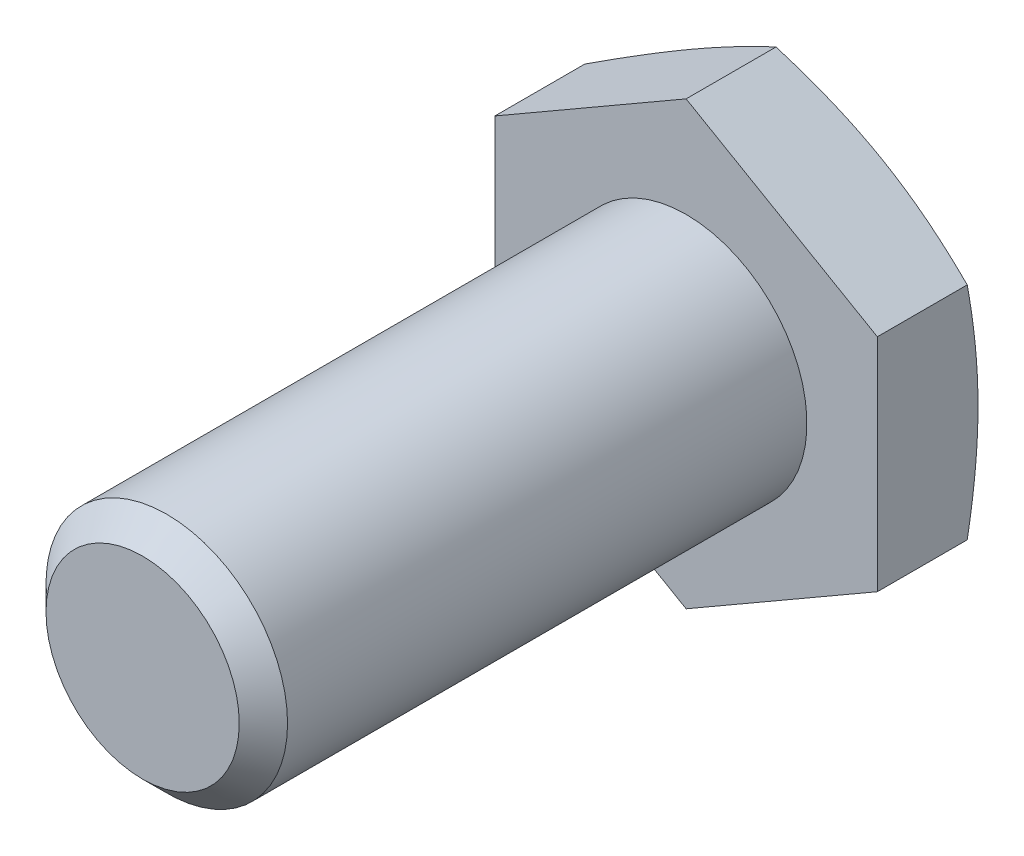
ISO-10303-21;
HEADER;
FILE_DESCRIPTION(('STEP AP214'),'2;1');
FILE_NAME('part.step','',(''),(''),'','','');
FILE_SCHEMA(('AUTOMOTIVE_DESIGN { 1 0 10303 214 1 1 1 1 }'));
ENDSEC;
DATA;
#1=APPLICATION_CONTEXT('core data for automotive mechanical design processes');
#2=APPLICATION_PROTOCOL_DEFINITION('international standard','automotive_design',2000,#1);
#3=PRODUCT_CONTEXT('',#1,'mechanical');
#4=PRODUCT('Part','Part','',(#3));
#5=PRODUCT_RELATED_PRODUCT_CATEGORY('part','',(#4));
#6=PRODUCT_DEFINITION_FORMATION('','',#4);
#7=PRODUCT_DEFINITION_CONTEXT('part definition',#1,'design');
#8=PRODUCT_DEFINITION('design','',#6,#7);
#9=PRODUCT_DEFINITION_SHAPE('','',#8);
#10=(LENGTH_UNIT() NAMED_UNIT(*) SI_UNIT(.MILLI.,.METRE.));
#11=(NAMED_UNIT(*) PLANE_ANGLE_UNIT() SI_UNIT($,.RADIAN.));
#12=(NAMED_UNIT(*) SI_UNIT($,.STERADIAN.) SOLID_ANGLE_UNIT());
#13=UNCERTAINTY_MEASURE_WITH_UNIT(LENGTH_MEASURE(1.E-05),#10,'distance_accuracy_value','');
#14=(GEOMETRIC_REPRESENTATION_CONTEXT(3) GLOBAL_UNCERTAINTY_ASSIGNED_CONTEXT((#13)) GLOBAL_UNIT_ASSIGNED_CONTEXT((#10,
#11,#12)) REPRESENTATION_CONTEXT('',''));
#15=CARTESIAN_POINT('',(0.,0.,0.));
#16=DIRECTION('',(0.,0.,1.));
#17=DIRECTION('',(1.,0.,0.));
#18=AXIS2_PLACEMENT_3D('',#15,#16,#17);
#19=CARTESIAN_POINT('',(0.,0.,20.46325));
#20=DIRECTION('',(0.,0.,1.));
#21=DIRECTION('',(0.,1.,0.));
#22=AXIS2_PLACEMENT_3D('',#19,#20,#21);
#23=CYLINDRICAL_SURFACE('',#22,6.);
#24=CARTESIAN_POINT('',(0.,0.,30.8));
#25=DIRECTION('',(0.,0.,1.));
#26=DIRECTION('',(1.,0.,0.));
#27=AXIS2_PLACEMENT_3D('',#24,#25,#26);
#28=CIRCLE('',#27,6.);
#29=CARTESIAN_POINT('',(6.,0.,30.8));
#30=VERTEX_POINT('',#29);
#31=EDGE_CURVE('E9',#30,#30,#28,.F.);
#32=ORIENTED_EDGE('',*,*,#31,.T.);
#33=EDGE_LOOP('',(#32));
#34=FACE_BOUND('',#33,.T.);
#35=CARTESIAN_POINT('',(0.,0.,5.));
#36=DIRECTION('',(0.,0.,1.));
#37=DIRECTION('',(0.,1.,0.));
#38=AXIS2_PLACEMENT_3D('',#35,#36,#37);
#39=CIRCLE('',#38,6.);
#40=CARTESIAN_POINT('',(0.,6.,5.));
#41=VERTEX_POINT('',#40);
#42=EDGE_CURVE('E194',#41,#41,#39,.F.);
#43=ORIENTED_EDGE('',*,*,#42,.F.);
#44=EDGE_LOOP('',(#43));
#45=FACE_BOUND('',#44,.T.);
#46=ADVANCED_FACE('F14',(#34,#45),#23,.T.);
#47=CARTESIAN_POINT('',(-9.5,5.48482755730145,0.));
#48=DIRECTION('',(0.5,-0.866025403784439,0.));
#49=DIRECTION('',(0.866025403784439,0.5,0.));
#50=AXIS2_PLACEMENT_3D('',#47,#48,#49);
#51=PLANE('',#50);
#52=CARTESIAN_POINT('',(-9.5002,5.48471208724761,0.534952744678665));
#53=CARTESIAN_POINT('',(-9.1067676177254,5.71186037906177,0.452247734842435));
#54=CARTESIAN_POINT('',(-8.71203788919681,5.9397576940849,0.377013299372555));
#55=CARTESIAN_POINT('',(-7.9200119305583,6.39703409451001,0.244650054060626));
#56=CARTESIAN_POINT('',(-7.52271393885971,6.62641419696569,0.187535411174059));
#57=CARTESIAN_POINT('',(-6.72996042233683,7.0841106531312,0.0951541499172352));
#58=CARTESIAN_POINT('',(-6.33452300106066,7.31241655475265,0.0596860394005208));
#59=CARTESIAN_POINT('',(-5.54272345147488,7.76956223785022,0.0121133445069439));
#60=CARTESIAN_POINT('',(-5.14636172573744,7.9984017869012,0.));
#61=CARTESIAN_POINT('',(-4.35363827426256,8.45608088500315,0.));
#62=CARTESIAN_POINT('',(-3.95727654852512,8.68492043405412,0.0121133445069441));
#63=CARTESIAN_POINT('',(-3.16547699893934,9.1420661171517,0.0596860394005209));
#64=CARTESIAN_POINT('',(-2.77003957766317,9.37037201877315,0.0951541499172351));
#65=CARTESIAN_POINT('',(-1.97728606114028,9.82806847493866,0.187535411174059));
#66=CARTESIAN_POINT('',(-1.5799880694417,10.0574485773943,0.244650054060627));
#67=CARTESIAN_POINT('',(-0.787962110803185,10.5147249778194,0.377013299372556));
#68=CARTESIAN_POINT('',(-0.393232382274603,10.7426222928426,0.452247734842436));
#69=CARTESIAN_POINT('',(0.000200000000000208,10.9697705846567,0.534952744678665));
#70=B_SPLINE_CURVE_WITH_KNOTS('',3,(#52,#53,#54,#55,#56,#57,#58,#59,#60,#61,#62,#63,#64,#65,#66,
#67,#68,#69),.UNSPECIFIED.,.F.,.F.,(4,2,2,2,2,2,2,2,4),(0.,1.38543330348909,2.7719471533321,
4.14534984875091,5.51823729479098,6.89112474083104,8.26452743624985,9.65104128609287,
11.036474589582),.UNSPECIFIED.);
#71=CARTESIAN_POINT('',(-9.5,5.48482755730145,0.534910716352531));
#72=VERTEX_POINT('',#71);
#73=CARTESIAN_POINT('',(-4.75,8.22724133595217,0.));
#74=VERTEX_POINT('',#73);
#75=EDGE_CURVE('E84',#72,#74,#70,.T.);
#76=ORIENTED_EDGE('',*,*,#75,.F.);
#77=DIRECTION('',(0.,0.,1.));
#78=VECTOR('',#77,1.);
#79=CARTESIAN_POINT('',(-9.5,5.48482755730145,0.));
#80=LINE('',#79,#78);
#81=CARTESIAN_POINT('',(-9.5,5.48482755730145,5.));
#82=VERTEX_POINT('',#81);
#83=EDGE_CURVE('E258',#72,#82,#80,.T.);
#84=ORIENTED_EDGE('',*,*,#83,.T.);
#85=DIRECTION('',(0.866025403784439,0.5,0.));
#86=VECTOR('',#85,1.);
#87=CARTESIAN_POINT('',(-9.5,5.48482755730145,5.));
#88=LINE('',#87,#86);
#89=CARTESIAN_POINT('',(0.,10.9696551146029,5.));
#90=VERTEX_POINT('',#89);
#91=EDGE_CURVE('E93',#82,#90,#88,.T.);
#92=ORIENTED_EDGE('',*,*,#91,.T.);
#93=DIRECTION('',(0.,0.,1.));
#94=VECTOR('',#93,1.);
#95=CARTESIAN_POINT('',(0.,10.9696551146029,0.));
#96=LINE('',#95,#94);
#97=CARTESIAN_POINT('',(0.,10.9696551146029,0.534910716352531));
#98=VERTEX_POINT('',#97);
#99=EDGE_CURVE('E112',#98,#90,#96,.T.);
#100=ORIENTED_EDGE('',*,*,#99,.F.);
#101=EDGE_CURVE('E94',#74,#98,#70,.T.);
#102=ORIENTED_EDGE('',*,*,#101,.F.);
#103=EDGE_LOOP('',(#76,#84,#92,#100,#102));
#104=FACE_BOUND('',#103,.T.);
#105=ADVANCED_FACE('F110',(#104),#51,.F.);
#106=CARTESIAN_POINT('',(0.,10.9696551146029,0.));
#107=DIRECTION('',(-0.5,-0.866025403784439,0.));
#108=DIRECTION('',(0.866025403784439,-0.5,0.));
#109=AXIS2_PLACEMENT_3D('',#106,#107,#108);
#110=PLANE('',#109);
#111=CARTESIAN_POINT('',(-0.00020000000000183,10.9697705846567,0.534952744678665));
#112=CARTESIAN_POINT('',(0.393232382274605,10.7426222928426,0.452247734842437));
#113=CARTESIAN_POINT('',(0.787962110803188,10.5147249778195,0.377013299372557));
#114=CARTESIAN_POINT('',(1.5799880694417,10.0574485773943,0.244650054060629));
#115=CARTESIAN_POINT('',(1.97728606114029,9.82806847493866,0.18753541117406));
#116=CARTESIAN_POINT('',(2.77003957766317,9.37037201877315,0.0951541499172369));
#117=CARTESIAN_POINT('',(3.16547699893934,9.1420661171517,0.0596860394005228));
#118=CARTESIAN_POINT('',(3.95727654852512,8.68492043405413,0.0121133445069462));
#119=CARTESIAN_POINT('',(4.35363827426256,8.45608088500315,0.));
#120=CARTESIAN_POINT('',(5.14636172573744,7.9984017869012,0.));
#121=CARTESIAN_POINT('',(5.54272345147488,7.76956223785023,0.012113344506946));
#122=CARTESIAN_POINT('',(6.33452300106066,7.31241655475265,0.0596860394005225));
#123=CARTESIAN_POINT('',(6.72996042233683,7.0841106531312,0.0951541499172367));
#124=CARTESIAN_POINT('',(7.52271393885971,6.62641419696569,0.18753541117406));
#125=CARTESIAN_POINT('',(7.9200119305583,6.39703409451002,0.244650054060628));
#126=CARTESIAN_POINT('',(8.71203788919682,5.9397576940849,0.377013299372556));
#127=CARTESIAN_POINT('',(9.1067676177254,5.71186037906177,0.452247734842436));
#128=CARTESIAN_POINT('',(9.5002,5.48471208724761,0.534952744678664));
#129=B_SPLINE_CURVE_WITH_KNOTS('',3,(#111,#112,#113,#114,#115,#116,#117,#118,#119,#120,#121,
#122,#123,#124,#125,#126,#127,#128),.UNSPECIFIED.,.F.,.F.,(4,2,2,2,2,2,2,2,4),(0.,
1.38543330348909,2.77194715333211,4.14534984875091,5.51823729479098,6.89112474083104,
8.26452743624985,9.65104128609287,11.036474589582),.UNSPECIFIED.);
#130=CARTESIAN_POINT('',(4.75,8.22724133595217,0.));
#131=VERTEX_POINT('',#130);
#132=EDGE_CURVE('E101',#98,#131,#129,.T.);
#133=ORIENTED_EDGE('',*,*,#132,.F.);
#134=ORIENTED_EDGE('',*,*,#99,.T.);
#135=DIRECTION('',(0.866025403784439,-0.5,0.));
#136=VECTOR('',#135,1.);
#137=CARTESIAN_POINT('',(0.,10.9696551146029,5.));
#138=LINE('',#137,#136);
#139=CARTESIAN_POINT('',(9.5,5.48482755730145,5.));
#140=VERTEX_POINT('',#139);
#141=EDGE_CURVE('E270',#90,#140,#138,.T.);
#142=ORIENTED_EDGE('',*,*,#141,.T.);
#143=DIRECTION('',(0.,0.,1.));
#144=VECTOR('',#143,1.);
#145=CARTESIAN_POINT('',(9.5,5.48482755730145,0.));
#146=LINE('',#145,#144);
#147=CARTESIAN_POINT('',(9.5,5.48482755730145,0.534910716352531));
#148=VERTEX_POINT('',#147);
#149=EDGE_CURVE('E199',#148,#140,#146,.T.);
#150=ORIENTED_EDGE('',*,*,#149,.F.);
#151=EDGE_CURVE('E113',#131,#148,#129,.T.);
#152=ORIENTED_EDGE('',*,*,#151,.F.);
#153=EDGE_LOOP('',(#133,#134,#142,#150,#152));
#154=FACE_BOUND('',#153,.T.);
#155=ADVANCED_FACE('F174',(#154),#110,.F.);
#156=CARTESIAN_POINT('',(9.5,5.48482755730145,0.));
#157=DIRECTION('',(-1.,0.,0.));
#158=DIRECTION('',(0.,-1.,0.));
#159=AXIS2_PLACEMENT_3D('',#156,#157,#158);
#160=PLANE('',#159);
#161=CARTESIAN_POINT('',(9.5,-14.6309135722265,2.89159336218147));
#162=CARTESIAN_POINT('',(9.5,-14.1998786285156,2.7600499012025));
#163=CARTESIAN_POINT('',(9.5,-13.7683740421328,2.63001767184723));
#164=CARTESIAN_POINT('',(9.5,-12.9041861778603,2.3738115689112));
#165=CARTESIAN_POINT('',(9.5,-12.47150281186,2.24763799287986));
#166=CARTESIAN_POINT('',(9.5,-11.6040051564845,1.99978299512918));
#167=CARTESIAN_POINT('',(9.5,-11.1691884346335,1.87811005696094));
#168=CARTESIAN_POINT('',(9.5,-10.2979524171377,1.64065204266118));
#169=CARTESIAN_POINT('',(9.5,-9.86153314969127,1.52486686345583));
#170=CARTESIAN_POINT('',(9.5,-8.99217782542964,1.30202273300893));
#171=CARTESIAN_POINT('',(9.5,-8.55926489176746,1.19487401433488));
#172=CARTESIAN_POINT('',(9.5,-7.69129747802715,0.989535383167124));
#173=CARTESIAN_POINT('',(9.5,-7.25624296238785,0.891345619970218));
#174=CARTESIAN_POINT('',(9.5,-6.38387219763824,0.706177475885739));
#175=CARTESIAN_POINT('',(9.5,-5.94655667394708,0.619195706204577));
#176=CARTESIAN_POINT('',(9.5,-5.06938183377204,0.459061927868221));
#177=CARTESIAN_POINT('',(9.5,-4.62952260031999,0.385909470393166));
#178=CARTESIAN_POINT('',(9.5,-3.79653815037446,0.263604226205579));
#179=CARTESIAN_POINT('',(9.5,-3.40367484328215,0.212684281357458));
#180=CARTESIAN_POINT('',(9.5,-2.61625424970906,0.126124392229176));
#181=CARTESIAN_POINT('',(9.5,-2.22169701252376,0.0904840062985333));
#182=CARTESIAN_POINT('',(9.5,-1.43169160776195,0.0361978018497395));
#183=CARTESIAN_POINT('',(9.5,-1.03624432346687,0.0175393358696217));
#184=CARTESIAN_POINT('',(9.5,-0.244905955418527,-0.00183608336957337));
#185=CARTESIAN_POINT('',(9.5,0.150985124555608,-0.00255318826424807));
#186=CARTESIAN_POINT('',(9.5,0.944424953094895,0.0140366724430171));
#187=CARTESIAN_POINT('',(9.5,1.34197172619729,0.0314365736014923));
#188=CARTESIAN_POINT('',(9.5,2.13592669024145,0.0834642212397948));
#189=CARTESIAN_POINT('',(9.5,2.53233485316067,0.118092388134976));
#190=CARTESIAN_POINT('',(9.5,3.32380967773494,0.202933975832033));
#191=CARTESIAN_POINT('',(9.5,3.71887484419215,0.25316114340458));
#192=CARTESIAN_POINT('',(9.5,4.50702768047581,0.367130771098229));
#193=CARTESIAN_POINT('',(9.5,4.90011534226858,0.430873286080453));
#194=CARTESIAN_POINT('',(9.5,5.71532347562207,0.575266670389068));
#195=CARTESIAN_POINT('',(9.5,6.13727606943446,0.656857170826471));
#196=CARTESIAN_POINT('',(9.5,6.97895159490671,0.830893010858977));
#197=CARTESIAN_POINT('',(9.5,7.39867433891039,0.923339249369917));
#198=CARTESIAN_POINT('',(9.5,8.23621124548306,1.11703654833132));
#199=CARTESIAN_POINT('',(9.5,8.65402475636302,1.21829040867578));
#200=CARTESIAN_POINT('',(9.5,9.48785199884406,1.42787566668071));
#201=CARTESIAN_POINT('',(9.5,9.90386577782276,1.53620687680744));
#202=CARTESIAN_POINT('',(9.5,10.734936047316,1.7587464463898));
#203=CARTESIAN_POINT('',(9.5,11.1499903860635,1.87296281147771));
#204=CARTESIAN_POINT('',(9.5,11.9787867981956,2.10605530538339));
#205=CARTESIAN_POINT('',(9.5,12.3925288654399,2.22493145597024));
#206=CARTESIAN_POINT('',(9.5,13.2188199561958,2.46646846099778));
#207=CARTESIAN_POINT('',(9.5,13.6313691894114,2.58912859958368));
#208=CARTESIAN_POINT('',(9.5,14.4555220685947,2.83758902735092));
#209=CARTESIAN_POINT('',(9.5,14.8671257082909,2.9633893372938));
#210=CARTESIAN_POINT('',(9.5,16.0914965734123,3.34181762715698));
#211=CARTESIAN_POINT('',(9.5,16.9030990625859,3.59821304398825));
#212=CARTESIAN_POINT('',(9.5,18.5240472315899,4.11814919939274));
#213=CARTESIAN_POINT('',(9.5,19.3333927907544,4.38169031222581));
#214=CARTESIAN_POINT('',(9.5,20.9471132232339,4.91291456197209));
#215=CARTESIAN_POINT('',(9.5,21.7514949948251,5.18057677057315));
#216=CARTESIAN_POINT('',(9.5,22.9570565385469,5.58496407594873));
#217=CARTESIAN_POINT('',(9.5,23.3587249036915,5.7202363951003));
#218=CARTESIAN_POINT('',(9.5,24.161772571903,5.99163334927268));
#219=CARTESIAN_POINT('',(9.5,24.5631518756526,6.12775798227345));
#220=CARTESIAN_POINT('',(9.5,24.9644058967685,6.26425110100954));
#221=B_SPLINE_CURVE_WITH_KNOTS('',3,(#161,#162,#163,#164,#165,#166,#167,#168,#169,#170,#171,
#172,#173,#174,#175,#176,#177,#178,#179,#180,#181,#182,#183,#184,#185,#186,#187,#188,#189,#190,
#191,#192,#193,#194,#195,#196,#197,#198,#199,#200,#201,#202,#203,#204,#205,#206,#207,#208,#209,
#210,#211,#212,#213,#214,#215,#216,#217,#218,#219,#220),.UNSPECIFIED.,.F.,.F.,(4,2,2,2,2,2,2,2,
2,2,2,2,2,2,2,2,2,2,2,2,2,2,2,2,2,2,2,2,2,4),(0.,1.35199055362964,2.70408510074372,
4.05861037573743,5.41311192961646,6.75096418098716,8.08883872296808,9.42630779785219,
10.7637334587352,11.9519239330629,13.1400800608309,14.3273505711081,15.5146110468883,
16.70799200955,17.9014020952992,19.0958668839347,20.2903365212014,21.5794648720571,
22.8687000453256,24.1583465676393,25.4479589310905,26.7393744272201,28.0307959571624,
29.321974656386,30.6131618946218,33.1665239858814,35.7200200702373,38.2632435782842,
39.5347478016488,40.8062490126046),.UNSPECIFIED.);
#222=CARTESIAN_POINT('',(9.5,0.,0.));
#223=VERTEX_POINT('',#222);
#224=EDGE_CURVE('E168',#148,#223,#221,.F.);
#225=ORIENTED_EDGE('',*,*,#224,.F.);
#226=ORIENTED_EDGE('',*,*,#149,.T.);
#227=DIRECTION('',(0.,-1.,0.));
#228=VECTOR('',#227,1.);
#229=CARTESIAN_POINT('',(9.5,5.48482755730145,5.));
#230=LINE('',#229,#228);
#231=CARTESIAN_POINT('',(9.5,-5.48482755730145,5.));
#232=VERTEX_POINT('',#231);
#233=EDGE_CURVE('E267',#140,#232,#230,.T.);
#234=ORIENTED_EDGE('',*,*,#233,.T.);
#235=DIRECTION('',(0.,0.,1.));
#236=VECTOR('',#235,1.);
#237=CARTESIAN_POINT('',(9.5,-5.48482755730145,0.));
#238=LINE('',#237,#236);
#239=CARTESIAN_POINT('',(9.5,-5.48482755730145,0.53491071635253));
#240=VERTEX_POINT('',#239);
#241=EDGE_CURVE('E254',#240,#232,#238,.T.);
#242=ORIENTED_EDGE('',*,*,#241,.F.);
#243=EDGE_CURVE('E162',#223,#240,#221,.F.);
#244=ORIENTED_EDGE('',*,*,#243,.F.);
#245=EDGE_LOOP('',(#225,#226,#234,#242,#244));
#246=FACE_BOUND('',#245,.T.);
#247=ADVANCED_FACE('F170',(#246),#160,.F.);
#248=CARTESIAN_POINT('',(9.5,-5.48482755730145,0.));
#249=DIRECTION('',(-0.5,0.866025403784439,0.));
#250=DIRECTION('',(-0.866025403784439,-0.5,0.));
#251=AXIS2_PLACEMENT_3D('',#248,#249,#250);
#252=PLANE('',#251);
#253=CARTESIAN_POINT('',(9.5002,-5.48471208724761,0.534952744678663));
#254=CARTESIAN_POINT('',(9.1067676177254,-5.71186037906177,0.452247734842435));
#255=CARTESIAN_POINT('',(8.71203788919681,-5.93975769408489,0.377013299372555));
#256=CARTESIAN_POINT('',(7.9200119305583,-6.39703409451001,0.244650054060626));
#257=CARTESIAN_POINT('',(7.52271393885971,-6.62641419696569,0.187535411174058));
#258=CARTESIAN_POINT('',(6.72996042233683,-7.0841106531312,0.0951541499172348));
#259=CARTESIAN_POINT('',(6.33452300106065,-7.31241655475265,0.059686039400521));
#260=CARTESIAN_POINT('',(5.54272345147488,-7.76956223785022,0.0121133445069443));
#261=CARTESIAN_POINT('',(5.14636172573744,-7.9984017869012,0.));
#262=CARTESIAN_POINT('',(4.35363827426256,-8.45608088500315,0.));
#263=CARTESIAN_POINT('',(3.95727654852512,-8.68492043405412,0.0121133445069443));
#264=CARTESIAN_POINT('',(3.16547699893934,-9.1420661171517,0.0596860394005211));
#265=CARTESIAN_POINT('',(2.77003957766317,-9.37037201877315,0.0951541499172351));
#266=CARTESIAN_POINT('',(1.97728606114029,-9.82806847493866,0.187535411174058));
#267=CARTESIAN_POINT('',(1.5799880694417,-10.0574485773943,0.244650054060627));
#268=CARTESIAN_POINT('',(0.787962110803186,-10.5147249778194,0.377013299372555));
#269=CARTESIAN_POINT('',(0.393232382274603,-10.7426222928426,0.452247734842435));
#270=CARTESIAN_POINT('',(-0.000200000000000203,-10.9697705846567,0.534952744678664));
#271=B_SPLINE_CURVE_WITH_KNOTS('',3,(#253,#254,#255,#256,#257,#258,#259,#260,#261,#262,#263,
#264,#265,#266,#267,#268,#269,#270),.UNSPECIFIED.,.F.,.F.,(4,2,2,2,2,2,2,2,4),(0.,
1.38543330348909,2.77194715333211,4.14534984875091,5.51823729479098,6.89112474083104,
8.26452743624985,9.65104128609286,11.036474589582),.UNSPECIFIED.);
#272=CARTESIAN_POINT('',(4.75,-8.22724133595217,0.));
#273=VERTEX_POINT('',#272);
#274=EDGE_CURVE('E169',#240,#273,#271,.T.);
#275=ORIENTED_EDGE('',*,*,#274,.F.);
#276=ORIENTED_EDGE('',*,*,#241,.T.);
#277=DIRECTION('',(-0.866025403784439,-0.5,0.));
#278=VECTOR('',#277,1.);
#279=CARTESIAN_POINT('',(9.5,-5.48482755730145,5.));
#280=LINE('',#279,#278);
#281=CARTESIAN_POINT('',(0.,-10.9696551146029,5.));
#282=VERTEX_POINT('',#281);
#283=EDGE_CURVE('E252',#232,#282,#280,.T.);
#284=ORIENTED_EDGE('',*,*,#283,.T.);
#285=DIRECTION('',(0.,0.,1.));
#286=VECTOR('',#285,1.);
#287=CARTESIAN_POINT('',(0.,-10.9696551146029,0.));
#288=LINE('',#287,#286);
#289=CARTESIAN_POINT('',(0.,-10.9696551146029,0.534910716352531));
#290=VERTEX_POINT('',#289);
#291=EDGE_CURVE('E248',#290,#282,#288,.T.);
#292=ORIENTED_EDGE('',*,*,#291,.F.);
#293=EDGE_CURVE('E156',#273,#290,#271,.T.);
#294=ORIENTED_EDGE('',*,*,#293,.F.);
#295=EDGE_LOOP('',(#275,#276,#284,#292,#294));
#296=FACE_BOUND('',#295,.T.);
#297=ADVANCED_FACE('F173',(#296),#252,.F.);
#298=CARTESIAN_POINT('',(0.,-10.9696551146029,0.));
#299=DIRECTION('',(0.5,0.866025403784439,0.));
#300=DIRECTION('',(-0.866025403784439,0.5,0.));
#301=AXIS2_PLACEMENT_3D('',#298,#299,#300);
#302=PLANE('',#301);
#303=CARTESIAN_POINT('',(0.000199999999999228,-10.9697705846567,0.534952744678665));
#304=CARTESIAN_POINT('',(-0.393232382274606,-10.7426222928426,0.452247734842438));
#305=CARTESIAN_POINT('',(-0.78796211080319,-10.5147249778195,0.377013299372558));
#306=CARTESIAN_POINT('',(-1.5799880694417,-10.0574485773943,0.244650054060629));
#307=CARTESIAN_POINT('',(-1.97728606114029,-9.82806847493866,0.187535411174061));
#308=CARTESIAN_POINT('',(-2.77003957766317,-9.37037201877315,0.0951541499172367));
#309=CARTESIAN_POINT('',(-3.16547699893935,-9.1420661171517,0.0596860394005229));
#310=CARTESIAN_POINT('',(-3.95727654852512,-8.68492043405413,0.0121133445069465));
#311=CARTESIAN_POINT('',(-4.35363827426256,-8.45608088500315,0.));
#312=CARTESIAN_POINT('',(-5.14636172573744,-7.9984017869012,0.));
#313=CARTESIAN_POINT('',(-5.54272345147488,-7.76956223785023,0.0121133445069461));
#314=CARTESIAN_POINT('',(-6.33452300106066,-7.31241655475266,0.0596860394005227));
#315=CARTESIAN_POINT('',(-6.72996042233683,-7.08411065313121,0.0951541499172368));
#316=CARTESIAN_POINT('',(-7.52271393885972,-6.6264141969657,0.18753541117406));
#317=CARTESIAN_POINT('',(-7.9200119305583,-6.39703409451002,0.244650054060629));
#318=CARTESIAN_POINT('',(-8.71203788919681,-5.9397576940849,0.377013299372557));
#319=CARTESIAN_POINT('',(-9.1067676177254,-5.71186037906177,0.452247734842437));
#320=CARTESIAN_POINT('',(-9.5002,-5.48471208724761,0.534952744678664));
#321=B_SPLINE_CURVE_WITH_KNOTS('',3,(#303,#304,#305,#306,#307,#308,#309,#310,#311,#312,#313,
#314,#315,#316,#317,#318,#319,#320),.UNSPECIFIED.,.F.,.F.,(4,2,2,2,2,2,2,2,4),(0.,
1.38543330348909,2.7719471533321,4.14534984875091,5.51823729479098,6.89112474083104,
8.26452743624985,9.65104128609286,11.036474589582),.UNSPECIFIED.);
#322=CARTESIAN_POINT('',(-4.75,-8.22724133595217,0.));
#323=VERTEX_POINT('',#322);
#324=EDGE_CURVE('E239',#290,#323,#321,.T.);
#325=ORIENTED_EDGE('',*,*,#324,.F.);
#326=ORIENTED_EDGE('',*,*,#291,.T.);
#327=DIRECTION('',(-0.866025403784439,0.5,0.));
#328=VECTOR('',#327,1.);
#329=CARTESIAN_POINT('',(0.,-10.9696551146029,5.));
#330=LINE('',#329,#328);
#331=CARTESIAN_POINT('',(-9.5,-5.48482755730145,5.));
#332=VERTEX_POINT('',#331);
#333=EDGE_CURVE('E274',#282,#332,#330,.T.);
#334=ORIENTED_EDGE('',*,*,#333,.T.);
#335=DIRECTION('',(0.,0.,1.));
#336=VECTOR('',#335,1.);
#337=CARTESIAN_POINT('',(-9.5,-5.48482755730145,0.));
#338=LINE('',#337,#336);
#339=CARTESIAN_POINT('',(-9.5,-5.48482755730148,0.534910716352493));
#340=VERTEX_POINT('',#339);
#341=EDGE_CURVE('E255',#340,#332,#338,.T.);
#342=ORIENTED_EDGE('',*,*,#341,.F.);
#343=EDGE_CURVE('E148',#323,#340,#321,.T.);
#344=ORIENTED_EDGE('',*,*,#343,.F.);
#345=EDGE_LOOP('',(#325,#326,#334,#342,#344));
#346=FACE_BOUND('',#345,.T.);
#347=ADVANCED_FACE('F246',(#346),#302,.F.);
#348=CARTESIAN_POINT('',(-9.5,-5.48482755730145,0.));
#349=DIRECTION('',(1.,0.,0.));
#350=DIRECTION('',(0.,1.,0.));
#351=AXIS2_PLACEMENT_3D('',#348,#349,#350);
#352=PLANE('',#351);
#353=CARTESIAN_POINT('',(-9.5,-14.6309135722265,2.89159336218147));
#354=CARTESIAN_POINT('',(-9.5,-14.1998786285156,2.7600499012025));
#355=CARTESIAN_POINT('',(-9.5,-13.7683740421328,2.63001767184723));
#356=CARTESIAN_POINT('',(-9.5,-12.9041861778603,2.3738115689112));
#357=CARTESIAN_POINT('',(-9.5,-12.47150281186,2.24763799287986));
#358=CARTESIAN_POINT('',(-9.5,-11.6040051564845,1.99978299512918));
#359=CARTESIAN_POINT('',(-9.5,-11.1691884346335,1.87811005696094));
#360=CARTESIAN_POINT('',(-9.5,-10.2979524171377,1.64065204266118));
#361=CARTESIAN_POINT('',(-9.5,-9.86153314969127,1.52486686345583));
#362=CARTESIAN_POINT('',(-9.5,-8.99217782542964,1.30202273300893));
#363=CARTESIAN_POINT('',(-9.5,-8.55926489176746,1.19487401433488));
#364=CARTESIAN_POINT('',(-9.5,-7.69129747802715,0.989535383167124));
#365=CARTESIAN_POINT('',(-9.5,-7.25624296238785,0.891345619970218));
#366=CARTESIAN_POINT('',(-9.5,-6.38387219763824,0.706177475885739));
#367=CARTESIAN_POINT('',(-9.5,-5.94655667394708,0.619195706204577));
#368=CARTESIAN_POINT('',(-9.5,-5.06938183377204,0.459061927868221));
#369=CARTESIAN_POINT('',(-9.5,-4.62952260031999,0.385909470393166));
#370=CARTESIAN_POINT('',(-9.5,-3.79653815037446,0.263604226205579));
#371=CARTESIAN_POINT('',(-9.5,-3.40367484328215,0.212684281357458));
#372=CARTESIAN_POINT('',(-9.5,-2.61625424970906,0.126124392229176));
#373=CARTESIAN_POINT('',(-9.5,-2.22169701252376,0.0904840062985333));
#374=CARTESIAN_POINT('',(-9.5,-1.43169160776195,0.0361978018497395));
#375=CARTESIAN_POINT('',(-9.5,-1.03624432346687,0.0175393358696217));
#376=CARTESIAN_POINT('',(-9.5,-0.244905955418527,-0.00183608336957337));
#377=CARTESIAN_POINT('',(-9.5,0.150985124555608,-0.00255318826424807));
#378=CARTESIAN_POINT('',(-9.5,0.944424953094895,0.0140366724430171));
#379=CARTESIAN_POINT('',(-9.5,1.34197172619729,0.0314365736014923));
#380=CARTESIAN_POINT('',(-9.5,2.13592669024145,0.0834642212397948));
#381=CARTESIAN_POINT('',(-9.5,2.53233485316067,0.118092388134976));
#382=CARTESIAN_POINT('',(-9.5,3.32380967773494,0.202933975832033));
#383=CARTESIAN_POINT('',(-9.5,3.71887484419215,0.25316114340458));
#384=CARTESIAN_POINT('',(-9.5,4.50702768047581,0.367130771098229));
#385=CARTESIAN_POINT('',(-9.5,4.90011534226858,0.430873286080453));
#386=CARTESIAN_POINT('',(-9.5,5.71532347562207,0.575266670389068));
#387=CARTESIAN_POINT('',(-9.5,6.13727606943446,0.656857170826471));
#388=CARTESIAN_POINT('',(-9.5,6.97895159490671,0.830893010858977));
#389=CARTESIAN_POINT('',(-9.5,7.39867433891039,0.923339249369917));
#390=CARTESIAN_POINT('',(-9.5,8.23621124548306,1.11703654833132));
#391=CARTESIAN_POINT('',(-9.5,8.65402475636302,1.21829040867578));
#392=CARTESIAN_POINT('',(-9.5,9.48785199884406,1.42787566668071));
#393=CARTESIAN_POINT('',(-9.5,9.90386577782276,1.53620687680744));
#394=CARTESIAN_POINT('',(-9.5,10.734936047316,1.7587464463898));
#395=CARTESIAN_POINT('',(-9.5,11.1499903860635,1.87296281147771));
#396=CARTESIAN_POINT('',(-9.5,11.9787867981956,2.10605530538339));
#397=CARTESIAN_POINT('',(-9.5,12.3925288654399,2.22493145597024));
#398=CARTESIAN_POINT('',(-9.5,13.2188199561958,2.46646846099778));
#399=CARTESIAN_POINT('',(-9.5,13.6313691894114,2.58912859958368));
#400=CARTESIAN_POINT('',(-9.5,14.4555220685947,2.83758902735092));
#401=CARTESIAN_POINT('',(-9.5,14.8671257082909,2.9633893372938));
#402=CARTESIAN_POINT('',(-9.5,16.0914965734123,3.34181762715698));
#403=CARTESIAN_POINT('',(-9.5,16.9030990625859,3.59821304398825));
#404=CARTESIAN_POINT('',(-9.5,18.5240472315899,4.11814919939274));
#405=CARTESIAN_POINT('',(-9.5,19.3333927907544,4.38169031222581));
#406=CARTESIAN_POINT('',(-9.5,20.9471132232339,4.91291456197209));
#407=CARTESIAN_POINT('',(-9.5,21.7514949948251,5.18057677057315));
#408=CARTESIAN_POINT('',(-9.5,22.9570565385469,5.58496407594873));
#409=CARTESIAN_POINT('',(-9.5,23.3587249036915,5.7202363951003));
#410=CARTESIAN_POINT('',(-9.5,24.161772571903,5.99163334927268));
#411=CARTESIAN_POINT('',(-9.5,24.5631518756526,6.12775798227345));
#412=CARTESIAN_POINT('',(-9.5,24.9644058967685,6.26425110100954));
#413=B_SPLINE_CURVE_WITH_KNOTS('',3,(#353,#354,#355,#356,#357,#358,#359,#360,#361,#362,#363,
#364,#365,#366,#367,#368,#369,#370,#371,#372,#373,#374,#375,#376,#377,#378,#379,#380,#381,#382,
#383,#384,#385,#386,#387,#388,#389,#390,#391,#392,#393,#394,#395,#396,#397,#398,#399,#400,#401,
#402,#403,#404,#405,#406,#407,#408,#409,#410,#411,#412),.UNSPECIFIED.,.F.,.F.,(4,2,2,2,2,2,2,2,
2,2,2,2,2,2,2,2,2,2,2,2,2,2,2,2,2,2,2,2,2,4),(0.,1.35199055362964,2.70408510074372,
4.05861037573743,5.41311192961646,6.75096418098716,8.08883872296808,9.42630779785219,
10.7637334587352,11.9519239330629,13.1400800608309,14.3273505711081,15.5146110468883,
16.70799200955,17.9014020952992,19.0958668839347,20.2903365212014,21.5794648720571,
22.8687000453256,24.1583465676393,25.4479589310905,26.7393744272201,28.0307959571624,
29.321974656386,30.6131618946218,33.1665239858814,35.7200200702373,38.2632435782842,
39.5347478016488,40.8062490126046),.UNSPECIFIED.);
#414=CARTESIAN_POINT('',(-9.5,0.,0.));
#415=VERTEX_POINT('',#414);
#416=EDGE_CURVE('E283',#340,#415,#413,.T.);
#417=ORIENTED_EDGE('',*,*,#416,.F.);
#418=ORIENTED_EDGE('',*,*,#341,.T.);
#419=DIRECTION('',(0.,1.,0.));
#420=VECTOR('',#419,1.);
#421=CARTESIAN_POINT('',(-9.5,-5.48482755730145,5.));
#422=LINE('',#421,#420);
#423=EDGE_CURVE('E278',#332,#82,#422,.T.);
#424=ORIENTED_EDGE('',*,*,#423,.T.);
#425=ORIENTED_EDGE('',*,*,#83,.F.);
#426=EDGE_CURVE('E89',#415,#72,#413,.T.);
#427=ORIENTED_EDGE('',*,*,#426,.F.);
#428=EDGE_LOOP('',(#417,#418,#424,#425,#427));
#429=FACE_BOUND('',#428,.T.);
#430=ADVANCED_FACE('F235',(#429),#352,.F.);
#431=CARTESIAN_POINT('',(0.,0.,5.));
#432=DIRECTION('',(0.,0.,-1.));
#433=DIRECTION('',(0.,-1.,0.));
#434=AXIS2_PLACEMENT_3D('',#431,#432,#433);
#435=PLANE('',#434);
#436=ORIENTED_EDGE('',*,*,#42,.T.);
#437=EDGE_LOOP('',(#436));
#438=FACE_BOUND('',#437,.T.);
#439=ORIENTED_EDGE('',*,*,#91,.F.);
#440=ORIENTED_EDGE('',*,*,#423,.F.);
#441=ORIENTED_EDGE('',*,*,#333,.F.);
#442=ORIENTED_EDGE('',*,*,#283,.F.);
#443=ORIENTED_EDGE('',*,*,#233,.F.);
#444=ORIENTED_EDGE('',*,*,#141,.F.);
#445=EDGE_LOOP('',(#439,#440,#441,#442,#443,#444));
#446=FACE_BOUND('',#445,.T.);
#447=ADVANCED_FACE('F226',(#438,#446),#435,.F.);
#448=CARTESIAN_POINT('',(0.,0.,1.67665934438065));
#449=DIRECTION('',(0.,0.,1.));
#450=DIRECTION('',(0.,1.,0.));
#451=AXIS2_PLACEMENT_3D('',#448,#449,#450);
#452=CONICAL_SURFACE('',#451,14.1065836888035,1.22173047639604);
#453=ORIENTED_EDGE('',*,*,#293,.T.);
#454=ORIENTED_EDGE('',*,*,#324,.T.);
#455=CARTESIAN_POINT('',(0.,0.,0.));
#456=DIRECTION('',(0.,0.,-1.));
#457=DIRECTION('',(0.,-1.,0.));
#458=AXIS2_PLACEMENT_3D('',#455,#456,#457);
#459=CIRCLE('',#458,9.5);
#460=EDGE_CURVE('E196',#273,#323,#459,.T.);
#461=ORIENTED_EDGE('',*,*,#460,.F.);
#462=EDGE_LOOP('',(#453,#454,#461));
#463=FACE_BOUND('',#462,.T.);
#464=ADVANCED_FACE('F220',(#463),#452,.T.);
#465=ORIENTED_EDGE('',*,*,#243,.T.);
#466=ORIENTED_EDGE('',*,*,#274,.T.);
#467=EDGE_CURVE('E198',#223,#273,#459,.T.);
#468=ORIENTED_EDGE('',*,*,#467,.F.);
#469=EDGE_LOOP('',(#465,#466,#468));
#470=FACE_BOUND('',#469,.T.);
#471=ADVANCED_FACE('F225',(#470),#452,.T.);
#472=ORIENTED_EDGE('',*,*,#151,.T.);
#473=ORIENTED_EDGE('',*,*,#224,.T.);
#474=EDGE_CURVE('E105',#131,#223,#459,.T.);
#475=ORIENTED_EDGE('',*,*,#474,.F.);
#476=EDGE_LOOP('',(#472,#473,#475));
#477=FACE_BOUND('',#476,.T.);
#478=ADVANCED_FACE('F233',(#477),#452,.T.);
#479=ORIENTED_EDGE('',*,*,#101,.T.);
#480=ORIENTED_EDGE('',*,*,#132,.T.);
#481=EDGE_CURVE('E98',#74,#131,#459,.T.);
#482=ORIENTED_EDGE('',*,*,#481,.F.);
#483=EDGE_LOOP('',(#479,#480,#482));
#484=FACE_BOUND('',#483,.T.);
#485=ADVANCED_FACE('F99',(#484),#452,.T.);
#486=ORIENTED_EDGE('',*,*,#75,.T.);
#487=CARTESIAN_POINT('',(0.,0.,0.));
#488=DIRECTION('',(0.,0.,1.));
#489=DIRECTION('',(0.,1.,0.));
#490=AXIS2_PLACEMENT_3D('',#487,#488,#489);
#491=CIRCLE('',#490,9.5);
#492=EDGE_CURVE('E87',#74,#415,#491,.T.);
#493=ORIENTED_EDGE('',*,*,#492,.T.);
#494=ORIENTED_EDGE('',*,*,#426,.T.);
#495=EDGE_LOOP('',(#486,#493,#494));
#496=FACE_BOUND('',#495,.T.);
#497=ADVANCED_FACE('F86',(#496),#452,.T.);
#498=ORIENTED_EDGE('',*,*,#343,.T.);
#499=ORIENTED_EDGE('',*,*,#416,.T.);
#500=EDGE_CURVE('E29',#323,#415,#459,.T.);
#501=ORIENTED_EDGE('',*,*,#500,.F.);
#502=EDGE_LOOP('',(#498,#499,#501));
#503=FACE_BOUND('',#502,.T.);
#504=ADVANCED_FACE('F134',(#503),#452,.T.);
#505=CARTESIAN_POINT('',(0.,0.,0.));
#506=DIRECTION('',(0.,0.,-1.));
#507=DIRECTION('',(0.,-1.,0.));
#508=AXIS2_PLACEMENT_3D('',#505,#506,#507);
#509=PLANE('',#508);
#510=ORIENTED_EDGE('',*,*,#460,.T.);
#511=ORIENTED_EDGE('',*,*,#500,.T.);
#512=ORIENTED_EDGE('',*,*,#492,.F.);
#513=ORIENTED_EDGE('',*,*,#481,.T.);
#514=ORIENTED_EDGE('',*,*,#474,.T.);
#515=ORIENTED_EDGE('',*,*,#467,.T.);
#516=EDGE_LOOP('',(#510,#511,#512,#513,#514,#515));
#517=FACE_BOUND('',#516,.T.);
#518=ADVANCED_FACE('F107',(#517),#509,.T.);
#519=CARTESIAN_POINT('',(0.,0.,32.));
#520=DIRECTION('',(0.,0.,1.));
#521=DIRECTION('',(1.,0.,0.));
#522=AXIS2_PLACEMENT_3D('',#519,#520,#521);
#523=PLANE('',#522);
#524=CARTESIAN_POINT('',(0.,0.,32.));
#525=DIRECTION('',(0.,0.,1.));
#526=DIRECTION('',(1.,0.,0.));
#527=AXIS2_PLACEMENT_3D('',#524,#525,#526);
#528=CIRCLE('',#527,4.8);
#529=CARTESIAN_POINT('',(4.8,0.,32.));
#530=VERTEX_POINT('',#529);
#531=EDGE_CURVE('E22',#530,#530,#528,.T.);
#532=ORIENTED_EDGE('',*,*,#531,.T.);
#533=EDGE_LOOP('',(#532));
#534=FACE_BOUND('',#533,.T.);
#535=ADVANCED_FACE('F135',(#534),#523,.T.);
#536=CARTESIAN_POINT('',(0.,0.,32.));
#537=DIRECTION('',(0.,0.,-1.));
#538=DIRECTION('',(-1.,0.,0.));
#539=AXIS2_PLACEMENT_3D('',#536,#537,#538);
#540=CONICAL_SURFACE('',#539,4.8,0.785398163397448);
#541=ORIENTED_EDGE('',*,*,#31,.F.);
#542=EDGE_LOOP('',(#541));
#543=FACE_BOUND('',#542,.T.);
#544=ORIENTED_EDGE('',*,*,#531,.F.);
#545=EDGE_LOOP('',(#544));
#546=FACE_BOUND('',#545,.T.);
#547=ADVANCED_FACE('F16',(#543,#546),#540,.T.);
#548=CLOSED_SHELL('',(#46,#105,#155,#247,#297,#347,#430,#447,#464,#471,#478,#485,#497,#504,#518,
#535,#547));
#549=MANIFOLD_SOLID_BREP('B1',#548);
#550=ADVANCED_BREP_SHAPE_REPRESENTATION('',(#18,#549),#14);
#551=SHAPE_DEFINITION_REPRESENTATION(#9,#550);
ENDSEC;
END-ISO-10303-21;
